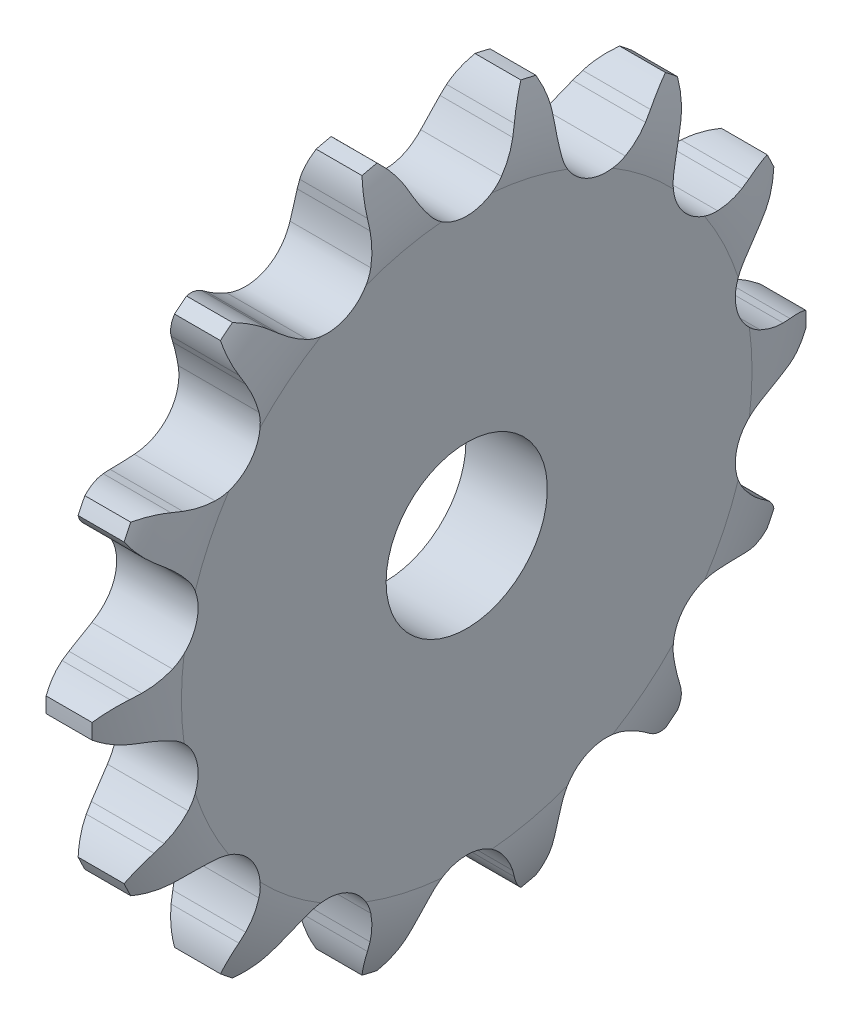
from build123d import *

# Parameters (mm, degrees)
TOOTHCUT_DEPTH  = 46.311767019
TEETHCUTS_COUNT = 14
TEETHCUTS_ANGLE = 334.285714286
BORSKE_R        = 7.14375
BORE_DEPTH      = 50.8000508


with BuildPart() as part:
    # BasProSke → Base-Revolve (revolve)
    with BuildSketch(Plane(origin=(0, 0, 0), x_dir=(1, 0, 0), z_dir=(0, 1, 0)), mode=Mode.PRIVATE) as base_revolve_sk:
        with BuildLine():
            Line((0, 0), (0, 25.281167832))
            ThreePointArc((0, 25.281167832), (0.399574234, 28.552348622), (1.5748, 31.631167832))
            Line((1.5748, 31.631167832), (5.642864, 31.631167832))
            ThreePointArc((5.642864, 31.631167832), (6.818089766, 28.552348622), (7.217664, 25.281167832))
            Line((7.217664, 25.281167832), (7.217664, 0))
            Line((7.217664, 0), (0, 0))
        make_face()
    revolve(base_revolve_sk.sketch.rotate(Axis((-10, 0, 0), (1, 0, 0)), 180), axis=Axis((-10, 0, 0), (1, 0, 0)))

    # TooCutSke → ToothCut (cut, through all)
    with BuildSketch(Plane(origin=(0, 0, 0), x_dir=(0, 0, -1), z_dir=(1, 0, 0))):
        with BuildLine():
            Line((4.460512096, 28.125794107), (4.825319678, 28.898048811))
            ThreePointArc((4.825319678, 28.898048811), (7.27030473, 31.665075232), (10.816552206, 32.69391728))
            ThreePointArc((10.816552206, 32.69391728), (0, 34.436754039), (-10.816552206, 32.69391728))
            ThreePointArc((-10.816552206, 32.69391728), (-7.27030473, 31.665075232), (-4.825319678, 28.898048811))
            Line((-4.825319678, 28.898048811), (-4.460512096, 28.125794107))
            ThreePointArc((-4.460512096, 28.125794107), (-3.851396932, 27.017163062), (-3.111713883, 25.99102805))
            ThreePointArc((-3.111713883, 25.99102805), (0, 24.516328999), (3.111713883, 25.99102805))
            ThreePointArc((3.111713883, 25.99102805), (3.851396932, 27.017163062), (4.460512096, 28.125794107))
        make_face()
    toothcut = extrude(amount=TOOTHCUT_DEPTH, mode=Mode.SUBTRACT)

    # TeethCuts: ToothCut ×14 about axis
    teethcuts_axis = Axis((-10, 0, 0), (1, 0, 0))
    for i in range(1, TEETHCUTS_COUNT):
        add(toothcut.rotate(teethcuts_axis, i * TEETHCUTS_ANGLE / (TEETHCUTS_COUNT - 1)), mode=Mode.SUBTRACT)

    # BorSke → Bore (cut, symmetric)
    with BuildSketch(Plane(origin=(0, 0, 0), x_dir=(0, 0, -1), z_dir=(1, 0, 0))):
        with Locations(Location((0, 0, 0), (0, 0, 180))):
            Circle(BORSKE_R)
    extrude(amount=BORE_DEPTH, both=True, mode=Mode.SUBTRACT)


solid = part.part
